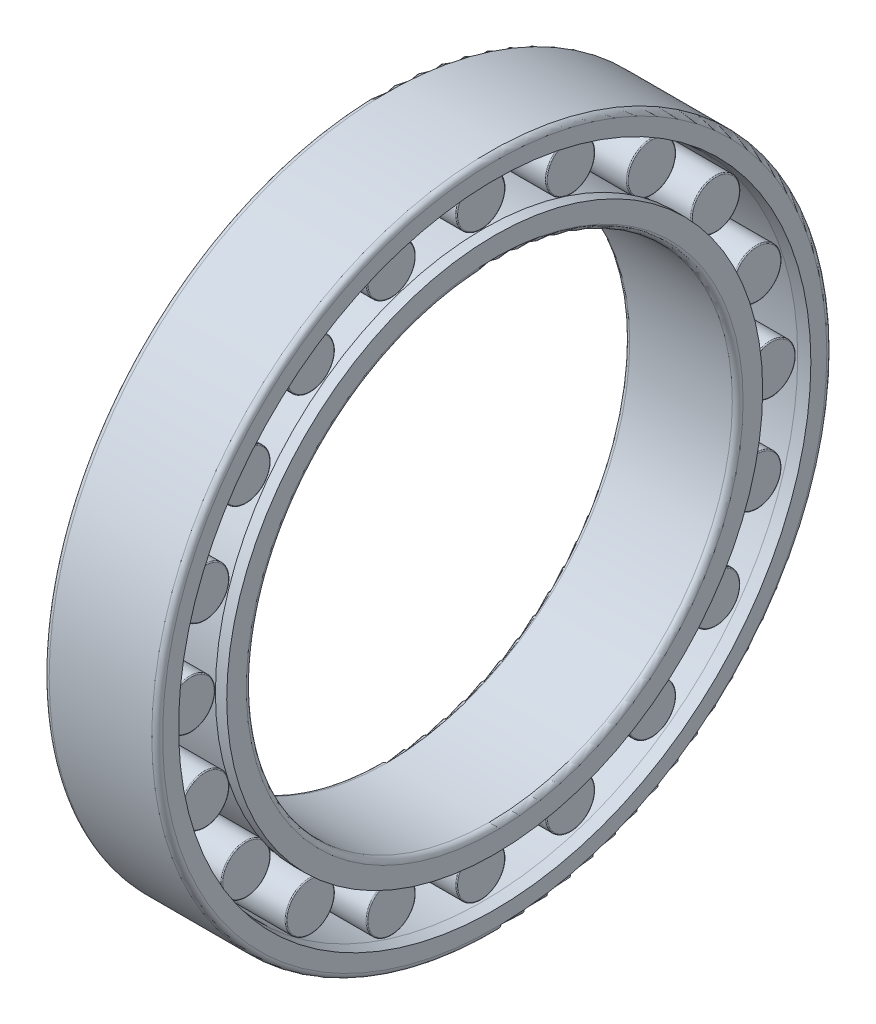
from build123d import *

# Parameters (mm, degrees)
ROLLERSDETAILED_COUNT = 20


with BuildPart() as part:
    # OutRacSke → OuterRace (revolve)
    with BuildSketch(Plane.XY, mode=Mode.PRIVATE) as outerrace_sk:
        with BuildLine():
            Line((16.8, 116.42), (21, 117.086666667))
            Line((21, 117.086666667), (21, 123))
            ThreePointArc((21, 123), (20.414213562, 124.414213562), (19, 125))
            Line((19, 125), (-19, 125))
            ThreePointArc((-19, 125), (-20.414213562, 124.414213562), (-21, 123))
            Line((-21, 123), (-21, 117.086666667))
            Line((-21, 117.086666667), (-16.8, 116.42))
            Line((-16.8, 116.42), (16.8, 116.42))
        make_face()
    revolve(outerrace_sk.sketch.rotate(Axis((-90, 0, 0), (1, 0, 0)), 270), axis=Axis((-90, 0, 0), (1, 0, 0)))

    # RolDetSke → RollerDetailed (revolve)
    with BuildSketch(Plane.XY, mode=Mode.PRIVATE) as rollerdetailed_sk:
        with BuildLine():
            Line((-15.96, 116.18512), (-15.96, 107.5))
            Line((-15.96, 107.5), (15.96, 107.5))
            Line((15.96, 107.5), (15.96, 116.18512))
            ThreePointArc((15.96, 116.18512), (15.854007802, 116.441007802), (15.59812, 116.547))
            Line((15.59812, 116.547), (-15.59812, 116.547))
            ThreePointArc((-15.59812, 116.547), (-15.854007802, 116.441007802), (-15.96, 116.18512))
        make_face()
    rollerdetailed = revolve(rollerdetailed_sk.sketch.rotate(Axis((-33.6, 107.5, 0), (1, 0, 0)), 270), axis=Axis((-33.6, 107.5, 0), (1, 0, 0)))

    # InsRacSke → InnerRace (revolve)
    with BuildSketch(Plane.XY, mode=Mode.PRIVATE) as innerrace_sk:
        with BuildLine():
            Line((16.8, 98.58), (16.8, 99.246666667))
            Line((16.8, 99.246666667), (21, 99.246666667))
            Line((21, 99.246666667), (21, 92))
            ThreePointArc((21, 92), (20.414213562, 90.585786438), (19, 90))
            Line((19, 90), (-19, 90))
            ThreePointArc((-19, 90), (-20.414213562, 90.585786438), (-21, 92))
            Line((-21, 92), (-21, 99.246666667))
            Line((-21, 99.246666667), (-16.8, 99.246666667))
            Line((-16.8, 99.246666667), (-16.8, 98.58))
            Line((-16.8, 98.58), (16.8, 98.58))
        make_face()
    revolve(innerrace_sk.sketch.rotate(Axis((-90, 0, 0), (1, 0, 0)), 270), axis=Axis((-90, 0, 0), (1, 0, 0)))

    # RollersDetailed: RollerDetailed ×20 about axis
    rollersdetailed_axis = Axis((0, 0, 0), (1, 0, 0))
    for i in range(1, ROLLERSDETAILED_COUNT):
        add(rollerdetailed.rotate(rollersdetailed_axis, i * 360 / ROLLERSDETAILED_COUNT))


solid = part.part
